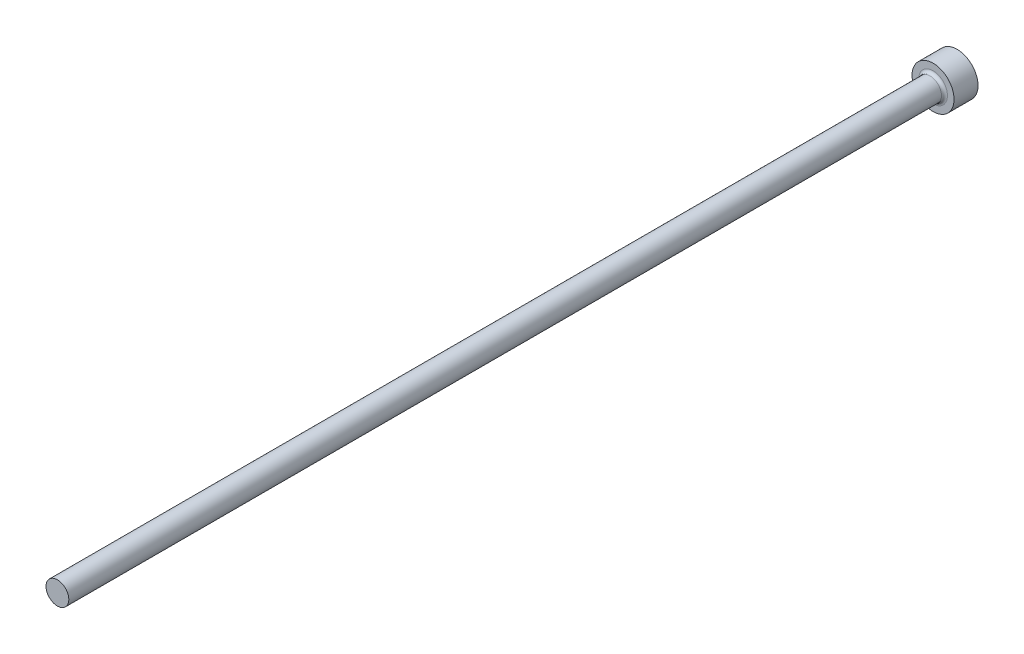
from build123d import *

# Parameters (mm, degrees)
FILLET1_R = 0.5


with BuildPart() as part:
    # FV → Revolve1 (revolve)
    with BuildSketch(Plane(origin=(0, 0, 0), x_dir=(1, 0, 0), z_dir=(0, 1, 0)), mode=Mode.PRIVATE) as revolve1_sk:
        Polygon((0, 0), (3.5, 0), (3.5, -4), (1.9, -4), (1.9, -150), (0, -150), align=None)
    revolve(revolve1_sk.sketch.rotate(Axis((0, 0, -9.033228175), (0, 0, 1)), 180), axis=Axis((0, 0, -9.033228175), (0, 0, 1)))

    # Fillet1
    fillet1_edges = [part.edges().sort_by_distance(p)[0] for p in [
        (1.9, 0, 4),
    ]]
    fillet(fillet1_edges, radius=FILLET1_R)


solid = part.part
